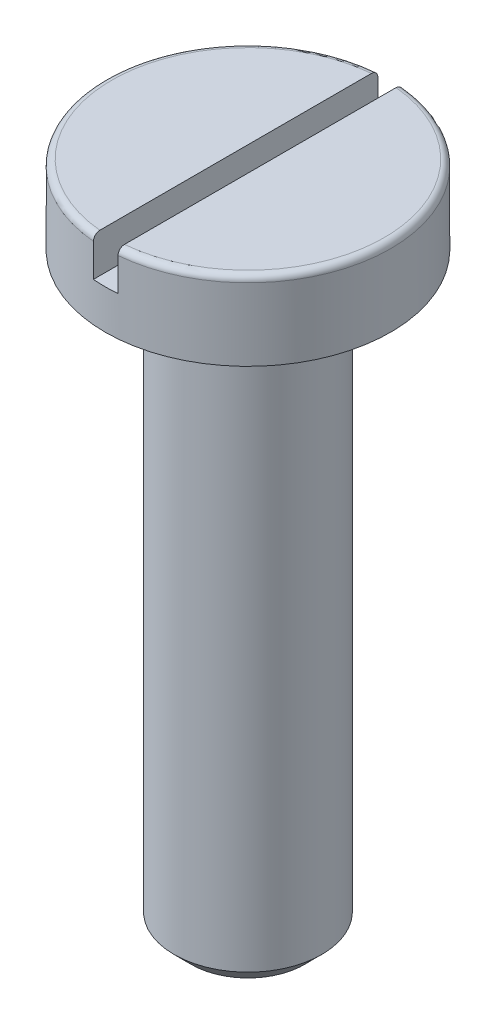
from build123d import *

# Parameters (mm, degrees)
ESQUISSE1_R             = 1.5
BASE_EXTRUSION_DEPTH    = 12
CHANFREIN1_SIZE         = 0.35
ESQUISSE3_W             = 0.5
ESQUISSE3_H             = 5.8
ENL_V_MAT_EXTRU_1_DEPTH = 0.8


with BuildPart() as part:
    # Esquisse1 → Base-Extrusion (new body)
    with BuildSketch(Plane(origin=(0, 0, 0), x_dir=(1, 0, 0), z_dir=(0, 1, 0))):
        with Locations(Location((0, 0, 0), (0, 0, 270))):
            Circle(ESQUISSE1_R)
    extrude(amount=-BASE_EXTRUSION_DEPTH)

    # Chanfrein1
    chanfrein1_edges = [part.edges().sort_by_distance(p)[0] for p in [
        (0, -12, -1.5),
    ]]
    chamfer(chanfrein1_edges, length=CHANFREIN1_SIZE)

    # Esquisse2 → Boss.-R_vol.1 (revolve)
    with BuildSketch(Plane.XY, mode=Mode.PRIVATE) as boss_r_vol_1_sk:
        with BuildLine():
            Line((0, 1.6), (0, 0))
            Line((0, 0), (2.9, 0))
            Line((2.9, 0), (2.9, 1.47))
            ThreePointArc((2.9, 1.47), (2.861923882, 1.561923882), (2.77, 1.6))
            Line((2.77, 1.6), (0, 1.6))
        make_face()
    revolve(boss_r_vol_1_sk.sketch.rotate(Axis((0, 1.3, 0), (0, -1, 0)), 90), axis=Axis((0, 1.3, 0), (0, -1, 0)))

    # Esquisse3 → Enl_v. mat.-Extru.1 (cut)
    with BuildSketch(Plane(origin=(0, 1.6, 0), x_dir=(-1, 0, 0), z_dir=(0, 1, 0))):
        Rectangle(ESQUISSE3_W, ESQUISSE3_H)
    extrude(amount=-ENL_V_MAT_EXTRU_1_DEPTH, mode=Mode.SUBTRACT)


solid = part.part
